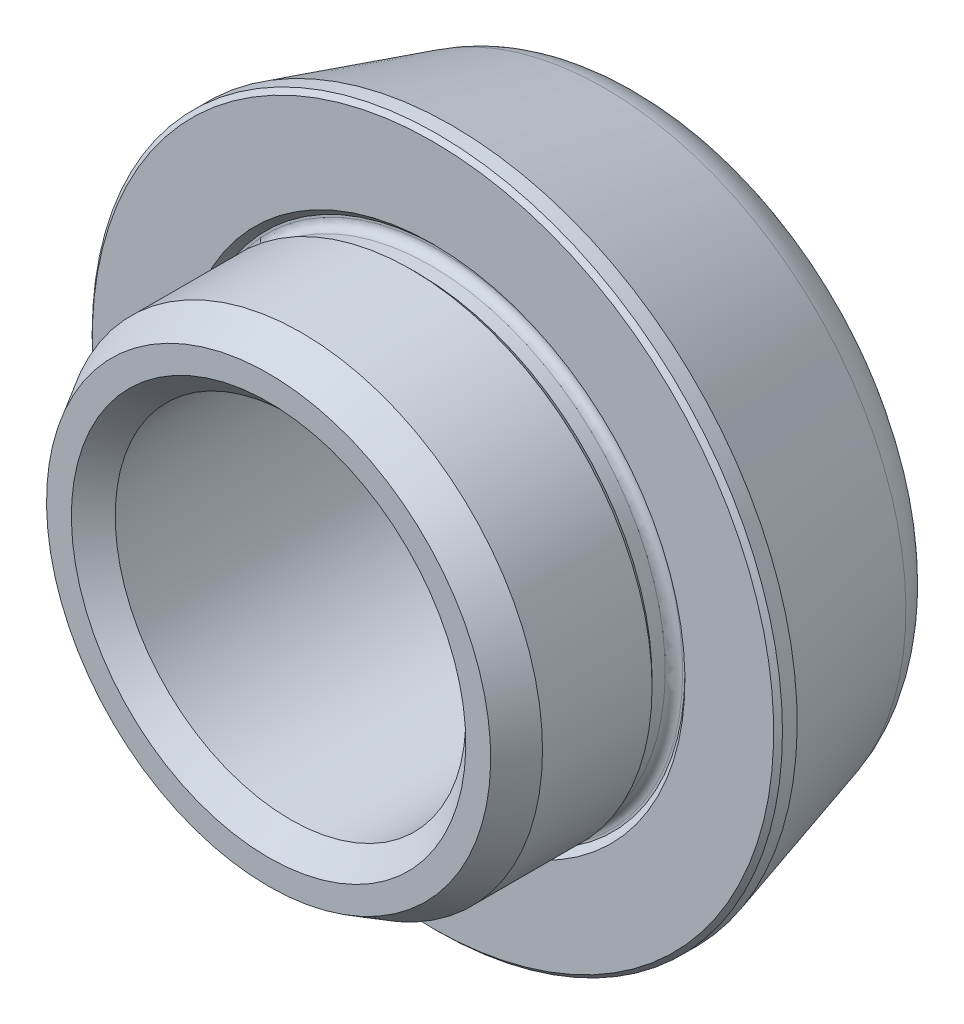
ISO-10303-21;
HEADER;
FILE_DESCRIPTION(('STEP AP214'),'2;1');
FILE_NAME('part.step','',(''),(''),'','','');
FILE_SCHEMA(('AUTOMOTIVE_DESIGN { 1 0 10303 214 1 1 1 1 }'));
ENDSEC;
DATA;
#1=APPLICATION_CONTEXT('core data for automotive mechanical design processes');
#2=APPLICATION_PROTOCOL_DEFINITION('international standard','automotive_design',2000,#1);
#3=PRODUCT_CONTEXT('',#1,'mechanical');
#4=PRODUCT('Part','Part','',(#3));
#5=PRODUCT_RELATED_PRODUCT_CATEGORY('part','',(#4));
#6=PRODUCT_DEFINITION_FORMATION('','',#4);
#7=PRODUCT_DEFINITION_CONTEXT('part definition',#1,'design');
#8=PRODUCT_DEFINITION('design','',#6,#7);
#9=PRODUCT_DEFINITION_SHAPE('','',#8);
#10=(LENGTH_UNIT() NAMED_UNIT(*) SI_UNIT(.MILLI.,.METRE.));
#11=(NAMED_UNIT(*) PLANE_ANGLE_UNIT() SI_UNIT($,.RADIAN.));
#12=(NAMED_UNIT(*) SI_UNIT($,.STERADIAN.) SOLID_ANGLE_UNIT());
#13=UNCERTAINTY_MEASURE_WITH_UNIT(LENGTH_MEASURE(1.E-05),#10,'distance_accuracy_value','');
#14=(GEOMETRIC_REPRESENTATION_CONTEXT(3) GLOBAL_UNCERTAINTY_ASSIGNED_CONTEXT((#13)) GLOBAL_UNIT_ASSIGNED_CONTEXT((#10,
#11,#12)) REPRESENTATION_CONTEXT('',''));
#15=CARTESIAN_POINT('',(0.,0.,0.));
#16=DIRECTION('',(0.,0.,1.));
#17=DIRECTION('',(1.,0.,0.));
#18=AXIS2_PLACEMENT_3D('',#15,#16,#17);
#19=CARTESIAN_POINT('',(0.,0.,0.));
#20=DIRECTION('',(0.,0.,-1.));
#21=DIRECTION('',(0.,1.,0.));
#22=AXIS2_PLACEMENT_3D('',#19,#20,#21);
#23=CYLINDRICAL_SURFACE('',#22,11.);
#24=CARTESIAN_POINT('',(0.,0.,1.));
#25=DIRECTION('',(0.,0.,-1.));
#26=DIRECTION('',(0.,1.,0.));
#27=AXIS2_PLACEMENT_3D('',#24,#25,#26);
#28=CIRCLE('',#27,11.);
#29=CARTESIAN_POINT('',(0.,11.,1.));
#30=VERTEX_POINT('',#29);
#31=EDGE_CURVE('E68',#30,#30,#28,.T.);
#32=ORIENTED_EDGE('',*,*,#31,.F.);
#33=EDGE_LOOP('',(#32));
#34=FACE_BOUND('',#33,.T.);
#35=CARTESIAN_POINT('',(0.,0.,6.));
#36=DIRECTION('',(0.,0.,1.));
#37=DIRECTION('',(0.,-1.,0.));
#38=AXIS2_PLACEMENT_3D('',#35,#36,#37);
#39=CIRCLE('',#38,11.);
#40=CARTESIAN_POINT('',(0.,-11.,6.));
#41=VERTEX_POINT('',#40);
#42=EDGE_CURVE('E47',#41,#41,#39,.F.);
#43=ORIENTED_EDGE('',*,*,#42,.T.);
#44=EDGE_LOOP('',(#43));
#45=FACE_BOUND('',#44,.T.);
#46=ADVANCED_FACE('F12',(#34,#45),#23,.T.);
#47=CARTESIAN_POINT('',(11.,0.,0.));
#48=DIRECTION('',(0.,0.,1.));
#49=DIRECTION('',(0.,-1.,0.));
#50=AXIS2_PLACEMENT_3D('',#47,#48,#49);
#51=PLANE('',#50);
#52=CARTESIAN_POINT('',(0.,0.,0.));
#53=DIRECTION('',(0.,0.,-1.));
#54=DIRECTION('',(0.,1.,0.));
#55=AXIS2_PLACEMENT_3D('',#52,#53,#54);
#56=CIRCLE('',#55,11.5);
#57=CARTESIAN_POINT('',(0.,11.5,0.));
#58=VERTEX_POINT('',#57);
#59=EDGE_CURVE('E59',#58,#58,#56,.T.);
#60=ORIENTED_EDGE('',*,*,#59,.T.);
#61=EDGE_LOOP('',(#60));
#62=FACE_BOUND('',#61,.T.);
#63=CARTESIAN_POINT('',(0.,0.,0.));
#64=DIRECTION('',(0.,0.,1.));
#65=DIRECTION('',(0.,-1.,0.));
#66=AXIS2_PLACEMENT_3D('',#63,#64,#65);
#67=CIRCLE('',#66,15.55);
#68=CARTESIAN_POINT('',(0.,-15.55,0.));
#69=VERTEX_POINT('',#68);
#70=EDGE_CURVE('E23',#69,#69,#67,.T.);
#71=ORIENTED_EDGE('',*,*,#70,.T.);
#72=EDGE_LOOP('',(#71));
#73=FACE_BOUND('',#72,.T.);
#74=ADVANCED_FACE('F76',(#62,#73),#51,.T.);
#75=CARTESIAN_POINT('',(0.,0.,0.));
#76=DIRECTION('',(0.,0.,-1.));
#77=DIRECTION('',(0.,1.,0.));
#78=AXIS2_PLACEMENT_3D('',#75,#76,#77);
#79=CYLINDRICAL_SURFACE('',#78,15.75);
#80=CARTESIAN_POINT('',(0.,0.,-0.199999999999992));
#81=DIRECTION('',(0.,0.,1.));
#82=DIRECTION('',(0.,-1.,0.));
#83=AXIS2_PLACEMENT_3D('',#80,#81,#82);
#84=CIRCLE('',#83,15.75);
#85=CARTESIAN_POINT('',(0.,-15.75,-0.199999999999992));
#86=VERTEX_POINT('',#85);
#87=EDGE_CURVE('E27',#86,#86,#84,.F.);
#88=ORIENTED_EDGE('',*,*,#87,.T.);
#89=EDGE_LOOP('',(#88));
#90=FACE_BOUND('',#89,.T.);
#91=CARTESIAN_POINT('',(0.,0.,-0.871853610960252));
#92=DIRECTION('',(0.,0.,-1.));
#93=DIRECTION('',(0.,1.,0.));
#94=AXIS2_PLACEMENT_3D('',#91,#92,#93);
#95=CIRCLE('',#94,15.75);
#96=CARTESIAN_POINT('',(0.,15.75,-0.871853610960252));
#97=VERTEX_POINT('',#96);
#98=EDGE_CURVE('E56',#97,#97,#95,.T.);
#99=ORIENTED_EDGE('',*,*,#98,.F.);
#100=EDGE_LOOP('',(#99));
#101=FACE_BOUND('',#100,.T.);
#102=ADVANCED_FACE('F115',(#90,#101),#79,.T.);
#103=CARTESIAN_POINT('',(0.,0.,-10.));
#104=DIRECTION('',(0.,0.,1.));
#105=DIRECTION('',(0.,-1.,0.));
#106=AXIS2_PLACEMENT_3D('',#103,#104,#105);
#107=CONICAL_SURFACE('',#106,13.132546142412,0.279252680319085);
#108=CARTESIAN_POINT('',(0.,0.,-7.82691206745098));
#109=DIRECTION('',(0.,0.,-1.));
#110=DIRECTION('',(0.,1.,0.));
#111=AXIS2_PLACEMENT_3D('',#108,#109,#110);
#112=CIRCLE('',#111,13.7556690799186);
#113=CARTESIAN_POINT('',(0.,13.7556690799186,-7.82691206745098));
#114=VERTEX_POINT('',#113);
#115=EDGE_CURVE('E50',#114,#114,#112,.F.);
#116=ORIENTED_EDGE('',*,*,#115,.T.);
#117=EDGE_LOOP('',(#116));
#118=FACE_BOUND('',#117,.T.);
#119=ORIENTED_EDGE('',*,*,#98,.T.);
#120=EDGE_LOOP('',(#119));
#121=FACE_BOUND('',#120,.T.);
#122=ADVANCED_FACE('F118',(#118,#121),#107,.T.);
#123=CARTESIAN_POINT('',(8.,0.,-10.));
#124=DIRECTION('',(0.,0.,-1.));
#125=DIRECTION('',(0.,1.,0.));
#126=AXIS2_PLACEMENT_3D('',#123,#124,#125);
#127=PLANE('',#126);
#128=CARTESIAN_POINT('',(0.,0.,-10.));
#129=DIRECTION('',(0.,0.,-1.));
#130=DIRECTION('',(0.,1.,0.));
#131=AXIS2_PLACEMENT_3D('',#128,#129,#130);
#132=CIRCLE('',#131,9.);
#133=CARTESIAN_POINT('',(0.,9.,-10.));
#134=VERTEX_POINT('',#133);
#135=EDGE_CURVE('E38',#134,#134,#132,.F.);
#136=ORIENTED_EDGE('',*,*,#135,.T.);
#137=EDGE_LOOP('',(#136));
#138=FACE_BOUND('',#137,.T.);
#139=CARTESIAN_POINT('',(0.,0.,-10.));
#140=DIRECTION('',(0.,0.,-1.));
#141=DIRECTION('',(0.,1.,0.));
#142=AXIS2_PLACEMENT_3D('',#139,#140,#141);
#143=CIRCLE('',#142,10.8718839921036);
#144=CARTESIAN_POINT('',(0.,10.8718839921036,-10.));
#145=VERTEX_POINT('',#144);
#146=EDGE_CURVE('E53',#145,#145,#143,.T.);
#147=ORIENTED_EDGE('',*,*,#146,.T.);
#148=EDGE_LOOP('',(#147));
#149=FACE_BOUND('',#148,.T.);
#150=ADVANCED_FACE('F123',(#138,#149),#127,.T.);
#151=CARTESIAN_POINT('',(0.,0.,0.));
#152=DIRECTION('',(0.,0.,-1.));
#153=DIRECTION('',(0.,1.,0.));
#154=AXIS2_PLACEMENT_3D('',#151,#152,#153);
#155=CYLINDRICAL_SURFACE('',#154,8.);
#156=CARTESIAN_POINT('',(0.,0.,-9.));
#157=DIRECTION('',(0.,0.,-1.));
#158=DIRECTION('',(0.,1.,0.));
#159=AXIS2_PLACEMENT_3D('',#156,#157,#158);
#160=CIRCLE('',#159,8.);
#161=CARTESIAN_POINT('',(0.,8.,-9.));
#162=VERTEX_POINT('',#161);
#163=EDGE_CURVE('E41',#162,#162,#160,.T.);
#164=ORIENTED_EDGE('',*,*,#163,.T.);
#165=EDGE_LOOP('',(#164));
#166=FACE_BOUND('',#165,.T.);
#167=CARTESIAN_POINT('',(0.,0.,6.5));
#168=DIRECTION('',(0.,0.,1.));
#169=DIRECTION('',(0.,-1.,0.));
#170=AXIS2_PLACEMENT_3D('',#167,#168,#169);
#171=CIRCLE('',#170,8.);
#172=CARTESIAN_POINT('',(0.,-8.,6.5));
#173=VERTEX_POINT('',#172);
#174=EDGE_CURVE('E32',#173,#173,#171,.T.);
#175=ORIENTED_EDGE('',*,*,#174,.T.);
#176=EDGE_LOOP('',(#175));
#177=FACE_BOUND('',#176,.T.);
#178=ADVANCED_FACE('F129',(#166,#177),#155,.F.);
#179=CARTESIAN_POINT('',(8.,0.,7.5));
#180=DIRECTION('',(0.,0.,1.));
#181=DIRECTION('',(0.,-1.,0.));
#182=AXIS2_PLACEMENT_3D('',#179,#180,#181);
#183=PLANE('',#182);
#184=CARTESIAN_POINT('',(0.,0.,7.5));
#185=DIRECTION('',(0.,0.,1.));
#186=DIRECTION('',(0.,-1.,0.));
#187=AXIS2_PLACEMENT_3D('',#184,#185,#186);
#188=CIRCLE('',#187,9.);
#189=CARTESIAN_POINT('',(0.,-9.,7.5));
#190=VERTEX_POINT('',#189);
#191=EDGE_CURVE('E35',#190,#190,#188,.F.);
#192=ORIENTED_EDGE('',*,*,#191,.T.);
#193=EDGE_LOOP('',(#192));
#194=FACE_BOUND('',#193,.T.);
#195=CARTESIAN_POINT('',(0.,0.,7.5));
#196=DIRECTION('',(0.,0.,1.));
#197=DIRECTION('',(0.,-1.,0.));
#198=AXIS2_PLACEMENT_3D('',#195,#196,#197);
#199=CIRCLE('',#198,10.1339745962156);
#200=CARTESIAN_POINT('',(0.,-10.1339745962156,7.5));
#201=VERTEX_POINT('',#200);
#202=EDGE_CURVE('E44',#201,#201,#199,.T.);
#203=ORIENTED_EDGE('',*,*,#202,.T.);
#204=EDGE_LOOP('',(#203));
#205=FACE_BOUND('',#204,.T.);
#206=ADVANCED_FACE('F94',(#194,#205),#183,.T.);
#207=CARTESIAN_POINT('',(0.,0.,-7.));
#208=DIRECTION('',(0.,0.,-1.));
#209=DIRECTION('',(0.,1.,0.));
#210=AXIS2_PLACEMENT_3D('',#207,#208,#209);
#211=TOROIDAL_SURFACE('',#210,10.8718839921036,3.);
#212=ORIENTED_EDGE('',*,*,#115,.F.);
#213=EDGE_LOOP('',(#212));
#214=FACE_BOUND('',#213,.T.);
#215=ORIENTED_EDGE('',*,*,#146,.F.);
#216=EDGE_LOOP('',(#215));
#217=FACE_BOUND('',#216,.T.);
#218=ADVANCED_FACE('F83',(#214,#217),#211,.T.);
#219=CARTESIAN_POINT('',(0.,0.,6.));
#220=DIRECTION('',(0.,0.,-1.));
#221=DIRECTION('',(0.,1.,0.));
#222=AXIS2_PLACEMENT_3D('',#219,#220,#221);
#223=CONICAL_SURFACE('',#222,11.,0.523598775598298);
#224=ORIENTED_EDGE('',*,*,#202,.F.);
#225=EDGE_LOOP('',(#224));
#226=FACE_BOUND('',#225,.T.);
#227=ORIENTED_EDGE('',*,*,#42,.F.);
#228=EDGE_LOOP('',(#227));
#229=FACE_BOUND('',#228,.T.);
#230=ADVANCED_FACE('F80',(#226,#229),#223,.T.);
#231=CARTESIAN_POINT('',(0.,0.,-9.));
#232=DIRECTION('',(0.,0.,-1.));
#233=DIRECTION('',(0.,1.,0.));
#234=AXIS2_PLACEMENT_3D('',#231,#232,#233);
#235=CONICAL_SURFACE('',#234,8.,0.785398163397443);
#236=ORIENTED_EDGE('',*,*,#135,.F.);
#237=EDGE_LOOP('',(#236));
#238=FACE_BOUND('',#237,.T.);
#239=ORIENTED_EDGE('',*,*,#163,.F.);
#240=EDGE_LOOP('',(#239));
#241=FACE_BOUND('',#240,.T.);
#242=ADVANCED_FACE('F82',(#238,#241),#235,.F.);
#243=CARTESIAN_POINT('',(0.,0.,7.5));
#244=DIRECTION('',(0.,0.,1.));
#245=DIRECTION('',(0.,-1.,0.));
#246=AXIS2_PLACEMENT_3D('',#243,#244,#245);
#247=CONICAL_SURFACE('',#246,9.,0.785398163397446);
#248=ORIENTED_EDGE('',*,*,#174,.F.);
#249=EDGE_LOOP('',(#248));
#250=FACE_BOUND('',#249,.T.);
#251=ORIENTED_EDGE('',*,*,#191,.F.);
#252=EDGE_LOOP('',(#251));
#253=FACE_BOUND('',#252,.T.);
#254=ADVANCED_FACE('F91',(#250,#253),#247,.F.);
#255=CARTESIAN_POINT('',(0.,0.,-0.199999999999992));
#256=DIRECTION('',(0.,0.,-1.));
#257=DIRECTION('',(0.,1.,0.));
#258=AXIS2_PLACEMENT_3D('',#255,#256,#257);
#259=CONICAL_SURFACE('',#258,15.75,0.785398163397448);
#260=ORIENTED_EDGE('',*,*,#70,.F.);
#261=EDGE_LOOP('',(#260));
#262=FACE_BOUND('',#261,.T.);
#263=ORIENTED_EDGE('',*,*,#87,.F.);
#264=EDGE_LOOP('',(#263));
#265=FACE_BOUND('',#264,.T.);
#266=ADVANCED_FACE('F100',(#262,#265),#259,.T.);
#267=CARTESIAN_POINT('',(0.,0.,-0.3));
#268=DIRECTION('',(0.,0.,1.));
#269=DIRECTION('',(0.,-1.,0.));
#270=AXIS2_PLACEMENT_3D('',#267,#268,#269);
#271=CONICAL_SURFACE('',#270,11.2,0.785398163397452);
#272=ORIENTED_EDGE('',*,*,#59,.F.);
#273=EDGE_LOOP('',(#272));
#274=FACE_BOUND('',#273,.T.);
#275=CARTESIAN_POINT('',(0.,0.,-0.3));
#276=DIRECTION('',(0.,0.,-1.));
#277=DIRECTION('',(0.,1.,0.));
#278=AXIS2_PLACEMENT_3D('',#275,#276,#277);
#279=CIRCLE('',#278,11.2);
#280=CARTESIAN_POINT('',(0.,11.2,-0.3));
#281=VERTEX_POINT('',#280);
#282=EDGE_CURVE('E62',#281,#281,#279,.T.);
#283=ORIENTED_EDGE('',*,*,#282,.T.);
#284=EDGE_LOOP('',(#283));
#285=FACE_BOUND('',#284,.T.);
#286=ADVANCED_FACE('F103',(#274,#285),#271,.F.);
#287=CARTESIAN_POINT('',(10.7,0.,-0.3));
#288=DIRECTION('',(0.,0.,-1.));
#289=DIRECTION('',(0.,1.,0.));
#290=AXIS2_PLACEMENT_3D('',#287,#288,#289);
#291=PLANE('',#290);
#292=CARTESIAN_POINT('',(0.,0.,-0.3));
#293=DIRECTION('',(0.,0.,-1.));
#294=DIRECTION('',(0.,1.,0.));
#295=AXIS2_PLACEMENT_3D('',#292,#293,#294);
#296=CIRCLE('',#295,11.1);
#297=CARTESIAN_POINT('',(0.,11.1,-0.3));
#298=VERTEX_POINT('',#297);
#299=EDGE_CURVE('E19',#298,#298,#296,.T.);
#300=ORIENTED_EDGE('',*,*,#299,.T.);
#301=EDGE_LOOP('',(#300));
#302=FACE_BOUND('',#301,.T.);
#303=ORIENTED_EDGE('',*,*,#282,.F.);
#304=EDGE_LOOP('',(#303));
#305=FACE_BOUND('',#304,.T.);
#306=ADVANCED_FACE('F108',(#302,#305),#291,.F.);
#307=CARTESIAN_POINT('',(0.,0.,0.));
#308=DIRECTION('',(0.,0.,-1.));
#309=DIRECTION('',(0.,1.,0.));
#310=AXIS2_PLACEMENT_3D('',#307,#308,#309);
#311=CYLINDRICAL_SURFACE('',#310,10.7);
#312=CARTESIAN_POINT('',(0.,0.,0.1));
#313=DIRECTION('',(0.,0.,-1.));
#314=DIRECTION('',(0.,1.,0.));
#315=AXIS2_PLACEMENT_3D('',#312,#313,#314);
#316=CIRCLE('',#315,10.7);
#317=CARTESIAN_POINT('',(0.,10.7,0.1));
#318=VERTEX_POINT('',#317);
#319=EDGE_CURVE('E8',#318,#318,#316,.F.);
#320=ORIENTED_EDGE('',*,*,#319,.T.);
#321=EDGE_LOOP('',(#320));
#322=FACE_BOUND('',#321,.T.);
#323=CARTESIAN_POINT('',(0.,0.,0.7));
#324=DIRECTION('',(0.,0.,-1.));
#325=DIRECTION('',(0.,1.,0.));
#326=AXIS2_PLACEMENT_3D('',#323,#324,#325);
#327=CIRCLE('',#326,10.7);
#328=CARTESIAN_POINT('',(0.,10.7,0.7));
#329=VERTEX_POINT('',#328);
#330=EDGE_CURVE('E65',#329,#329,#327,.T.);
#331=ORIENTED_EDGE('',*,*,#330,.T.);
#332=EDGE_LOOP('',(#331));
#333=FACE_BOUND('',#332,.T.);
#334=ADVANCED_FACE('F144',(#322,#333),#311,.T.);
#335=CARTESIAN_POINT('',(0.,0.,1.));
#336=DIRECTION('',(0.,0.,1.));
#337=DIRECTION('',(0.,-1.,0.));
#338=AXIS2_PLACEMENT_3D('',#335,#336,#337);
#339=CONICAL_SURFACE('',#338,11.,0.78539816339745);
#340=ORIENTED_EDGE('',*,*,#330,.F.);
#341=EDGE_LOOP('',(#340));
#342=FACE_BOUND('',#341,.T.);
#343=ORIENTED_EDGE('',*,*,#31,.T.);
#344=EDGE_LOOP('',(#343));
#345=FACE_BOUND('',#344,.T.);
#346=ADVANCED_FACE('F72',(#342,#345),#339,.T.);
#347=CARTESIAN_POINT('',(0.,0.,0.1));
#348=DIRECTION('',(0.,0.,-1.));
#349=DIRECTION('',(0.,1.,0.));
#350=AXIS2_PLACEMENT_3D('',#347,#348,#349);
#351=TOROIDAL_SURFACE('',#350,11.1,0.4);
#352=ORIENTED_EDGE('',*,*,#319,.F.);
#353=EDGE_LOOP('',(#352));
#354=FACE_BOUND('',#353,.T.);
#355=ORIENTED_EDGE('',*,*,#299,.F.);
#356=EDGE_LOOP('',(#355));
#357=FACE_BOUND('',#356,.T.);
#358=ADVANCED_FACE('F14',(#354,#357),#351,.F.);
#359=CLOSED_SHELL('',(#46,#74,#102,#122,#150,#178,#206,#218,#230,#242,#254,#266,#286,#306,#334,
#346,#358));
#360=MANIFOLD_SOLID_BREP('B1',#359);
#361=ADVANCED_BREP_SHAPE_REPRESENTATION('',(#18,#360),#14);
#362=SHAPE_DEFINITION_REPRESENTATION(#9,#361);
ENDSEC;
END-ISO-10303-21;
